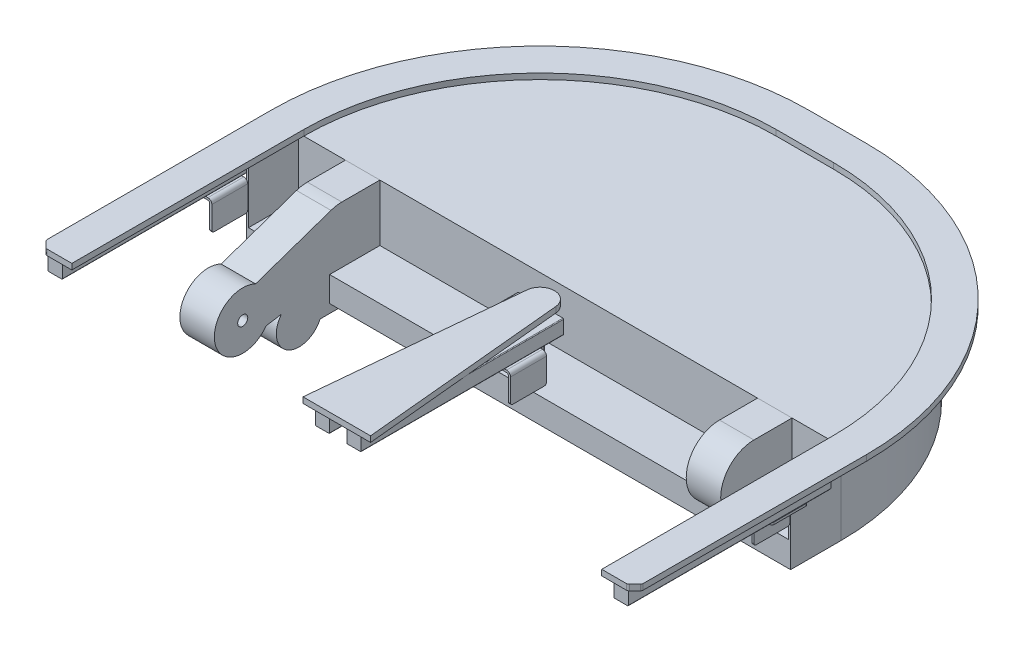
from build123d import *

# Parameters (mm, degrees)
BOSS_EXTRUDE1_DEPTH  = 114
BOSS_EXTRUDE2_DEPTH  = 35
SKETCH17_R           = 5.5
CUT_EXTRUDE3_DEPTH   = 30
BOSS_EXTRUDE7_START  = -65
SKETCH8_R            = 7
BOSS_EXTRUDE7_DEPTH  = 48
BOSS_EXTRUDE8_START  = -65
BOSS_EXTRUDE8_DEPTH  = 48
BOSS_EXTRUDE9_START  = -65
SKETCH11_R           = 7
BOSS_EXTRUDE9_DEPTH  = 48
BOSS_EXTRUDE3_DEPTH  = 122
BOSS_EXTRUDE4_DEPTH  = 8
SKETCH15_R           = 12.7
BOSS_EXTRUDE13_DEPTH = 79
SKETCH6_W            = 47
SKETCH6_H            = 330
BOSS_EXTRUDE6_DEPTH  = 8
CUT_EXTRUDE1_DEPTH   = 8
SKETCH12_W           = 46
SKETCH12_H           = 287
BOSS_EXTRUDE10_DEPTH = 8
CHAMFER2_SIZE        = 10
FILLET5_R            = 4
FILLET3_R            = 20
SKETCH13_W           = 20
SKETCH13_H           = 282
BOSS_EXTRUDE11_DEPTH = 20
BOSS_EXTRUDE12_START = -32
BOSS_EXTRUDE12_DEPTH = 50
FILLET6_R            = 3
FILLET7_R            = 1


with BuildPart() as part:
    # Sketch1 → Boss-Extrude1 (new body)
    with BuildSketch(Plane(origin=(0, 0, 0), x_dir=(1, 0, 0), z_dir=(0, 1, 0))):
        with BuildLine():
            Line((0, 0), (-336, 0))
            ThreePointArc((-336, 0), (-237.587878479, 237.587878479), (0, 336))
            Line((0, 336), (80, 336))
            ThreePointArc((80, 336), (317.587878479, 237.587878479), (416, 0))
            Line((416, 0), (80, 0))
            Line((80, 0), (0, 0))
        make_face()
    extrude(amount=BOSS_EXTRUDE1_DEPTH)

    # Sketch2 → Boss-Extrude2 (add)
    with BuildSketch(Plane.XZ):
        with BuildLine():
            Line((416, 70), (416, 0))
            ThreePointArc((416, 0), (317.587878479, -237.587878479), (80, -336))
            Line((80, -336), (0, -336))
            ThreePointArc((0, -336), (-237.587878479, -237.587878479), (-336, 0))
            Line((-336, 0), (-336, 70))
            Line((-336, 70), (416, 70))
        make_face()
    extrude(amount=-BOSS_EXTRUDE2_DEPTH)

    # Sketch17 → Cut-Extrude3 (cut)
    with BuildSketch(Plane.XZ):
        with Locations(Location((295.087878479, -215.087878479, 0), (0, 0, 270))):
            Circle(SKETCH17_R)
        with Locations(Location((-215.087878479, -215.087878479, 0), (0, 0, 270))):
            Circle(SKETCH17_R)
    extrude(amount=-CUT_EXTRUDE3_DEPTH, mode=Mode.SUBTRACT)

    # Sketch3 → Boss-Extrude3 (add)
    with BuildSketch(Plane.XZ):
        with BuildLine():
            Line((-336, 70), (-336, 0))
            ThreePointArc((-336, 0), (-237.587878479, -237.587878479), (0, -336))
            Line((0, -336), (80, -336))
            ThreePointArc((80, -336), (317.587878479, -237.587878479), (416, 0))
            Line((416, 0), (416, 70))
            Line((416, 70), (419, 70))
            Line((419, 70), (419, 0))
            ThreePointArc((419, 0), (319.709198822, -239.709198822), (80, -339))
            Line((80, -339), (0, -339))
            ThreePointArc((0, -339), (-239.709198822, -239.709198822), (-339, 0))
            Line((-339, 0), (-339, 70))
            Line((-339, 70), (-336, 70))
        make_face()
    extrude(amount=-BOSS_EXTRUDE3_DEPTH)

    # Sketch4 → Boss-Extrude4 (add)
    with BuildSketch(Plane(origin=(0, 122, 0), x_dir=(1, 0, 0), z_dir=(0, 1, 0))):
        with BuildLine():
            Line((0, 375), (80, 375))
            ThreePointArc((80, 375), (345.165042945, 265.165042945), (455, 0))
            Line((455, 0), (455, -36))
            Line((455, -36), (409, -36))
            Line((409, -36), (409, 0))
            ThreePointArc((409, 0), (312.63813101, 232.63813101), (80, 329))
            Line((80, 329), (0, 329))
            ThreePointArc((0, 329), (-232.63813101, 232.63813101), (-329, 0))
            Line((-329, 0), (-329, -36))
            Line((-329, -36), (-375, -36))
            Line((-375, -36), (-375, 0))
            ThreePointArc((-375, 0), (-265.165042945, 265.165042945), (0, 375))
        make_face()
    extrude(amount=-BOSS_EXTRUDE4_DEPTH)

    # Sketch15 → Boss-Extrude13 (add)
    with BuildSketch(Plane(origin=(0, 35, 0), x_dir=(1, 0, 0), z_dir=(0, 1, 0))):
        with Locations(Location((40, -52, 0), (0, 0, 90))):
            Circle(SKETCH15_R)
    extrude(amount=BOSS_EXTRUDE13_DEPTH)

    # Sketch6 → Boss-Extrude6 (add)
    with BuildSketch(Plane(origin=(0, 114, 0), x_dir=(1, 0, 0), z_dir=(0, 1, 0))):
        with Locations((16.5, -158)):
            Rectangle(SKETCH6_W, SKETCH6_H)
    boss_extrude6 = extrude(amount=BOSS_EXTRUDE6_DEPTH)

    # Mirror1: Boss-Extrude6 across plane
    add(boss_extrude6.mirror(Plane(origin=(40, 0, 0), x_dir=(0, 0, 1), z_dir=(1, 0, 0))))

    # Sketch7 → Cut-Extrude1 (cut)
    with BuildSketch(Plane(origin=(0, 122, 0), x_dir=(1, 0, 0), z_dir=(0, 1, 0))):
        Polygon((40, -19.806112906), (58.446601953, -21.553398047), (87, -323), (87, 7), (40, 47), (-7, 7), (-7, -323), (21.553398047, -21.553398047), align=None)
    extrude(amount=-CUT_EXTRUDE1_DEPTH, mode=Mode.SUBTRACT)

    # Sketch12 → Boss-Extrude10 (add)
    with BuildSketch(Plane(origin=(0, 122, 0), x_dir=(1, 0, 0), z_dir=(0, 1, 0))):
        with Locations((-352, -179.5)):
            Rectangle(SKETCH12_W, SKETCH12_H)
        with Locations((432, -179.5)):
            Rectangle(SKETCH12_W, SKETCH12_H)
    extrude(amount=-BOSS_EXTRUDE10_DEPTH)

    # Chamfer2
    chamfer2_edges = [part.edges().sort_by_distance(p)[0] for p in [
        (-375, 118, 323),
        (455, 118, 323),
    ]]
    chamfer(chamfer2_edges, length=CHAMFER2_SIZE)

    # Fillet5
    fillet5_edges = [part.edges().sort_by_distance(p)[0] for p in [
        (445, 118, 323),
        (455, 118, 313),
        (-375, 118, 313),
        (-365, 118, 323),
    ]]
    fillet(fillet5_edges, radius=FILLET5_R)

    # Fillet3
    fillet3_edges = [part.edges().sort_by_distance(p)[0] for p in [
        (58.446601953, 118, 21.553398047),
        (21.553398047, 118, 21.553398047),
        (40, 118, 19.806112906),
    ]]
    fillet(fillet3_edges, radius=FILLET3_R)


with BuildPart() as body_2:
    # Sketch8 → Boss-Extrude7 (new body)
    with BuildSketch(Plane.ZY.offset(336).offset(BOSS_EXTRUDE7_START)):
        with BuildLine():
            Line((0, 114), (0, 35))
            Line((0, 35), (70, 35))
            Line((70, 35), (70, 0))
            Line((70, 0), (3.5, 0))
            Line((3.5, 0), (3.5, -12))
            Line((3.5, -12), (83.365860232, -12))
            ThreePointArc((83.365860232, -12), (129.029933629, -26.487633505), (137.059598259, 20.741844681))
            Line((137.059598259, 20.741844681), (158.632713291, 17.289422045))
            ThreePointArc((158.632713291, 17.289422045), (229.356940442, 30.400170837), (173.14629846, 75.279695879))
            Line((173.14629846, 75.279695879), (68.09456753, 111.47266519))
            ThreePointArc((68.09456753, 111.47266519), (60.652342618, 113.363799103), (53, 114))
            Line((53, 114), (0, 114))
        make_face()
        with Locations((191, 40)):
            Circle(SKETCH8_R, mode=Mode.SUBTRACT)
    extrude(amount=-BOSS_EXTRUDE7_DEPTH)


with BuildPart() as body_3:
    # Sketch9 → Boss-Extrude8 (new body)
    with BuildSketch(Plane.ZY.offset(336).offset(BOSS_EXTRUDE8_START)):
        with BuildLine():
            Line((0, 114), (53, 114))
            ThreePointArc((53, 114), (98.52511331, 76.312147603), (70, 24.550887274))
            Line((70, 24.550887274), (70, 35))
            Line((70, 35), (0, 35))
            Line((0, 35), (0, 114))
        make_face()
    extrude(amount=-BOSS_EXTRUDE8_DEPTH)


with BuildPart() as body_4:
    # Sketch11 → Boss-Extrude9 (new body)
    with BuildSketch(Plane.ZY.offset(336).offset(BOSS_EXTRUDE9_START)):
        with BuildLine():
            Line((3.5, -12), (83.365860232, -12))
            ThreePointArc((83.365860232, -12), (129.029933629, -26.487633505), (137.059598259, 20.741844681))
            Line((137.059598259, 20.741844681), (158.632713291, 17.289422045))
            ThreePointArc((158.632713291, 17.289422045), (223.57663001, 17.590743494), (200.634662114, 78.348205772))
            Line((200.634662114, 78.348205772), (64.291609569, 112.60324369))
            ThreePointArc((64.291609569, 112.60324369), (58.688835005, 113.64948528), (53, 114))
            Line((53, 114), (0, 114))
            Line((0, 114), (0, 35))
            Line((0, 35), (70, 35))
            Line((70, 35), (70, 0))
            Line((70, 0), (3.5, 0))
            Line((3.5, 0), (3.5, -12))
        make_face()
        with Locations((191, 40)):
            Circle(SKETCH11_R, mode=Mode.SUBTRACT)
    extrude(amount=-BOSS_EXTRUDE9_DEPTH)


with BuildPart() as body_5:
    # Mirror3: mirrored copy
    add(body_2.part.mirror(Plane(origin=(40, 0, 0), x_dir=(0, 0, 1), z_dir=(1, 0, 0))))


with BuildPart() as body_6:
    # Mirror3 2: mirrored copy
    add(body_3.part.mirror(Plane(origin=(40, 0, 0), x_dir=(0, 0, 1), z_dir=(1, 0, 0))))


with BuildPart() as body_7:
    # Mirror3 3: mirrored copy
    add(body_4.part.mirror(Plane(origin=(40, 0, 0), x_dir=(0, 0, 1), z_dir=(1, 0, 0))))


with BuildPart() as body_4_2:
    # Sketch13 → Boss-Extrude11 (new body)
    with BuildSketch(Plane.XZ.offset(-114)):
        with Locations((-354, 180)):
            Rectangle(SKETCH13_W, SKETCH13_H)
    extrude(amount=BOSS_EXTRUDE11_DEPTH)

    # Fillet7
    fillet7_edges = [body_4_2.edges().sort_by_distance(p)[0] for p in [
        (-344, 94, 180),
        (-364, 94, 180),
        (-344, 114, 180),
        (-364, 114, 180),
    ]]
    fillet(fillet7_edges, radius=FILLET7_R)


with BuildPart() as body_5_2:
    # Sketch14 → Boss-Extrude12 (new body)
    with BuildSketch(Plane(origin=(0, 0, 39), x_dir=(-1, 0, 0), z_dir=(0, 0, -1)).offset(BOSS_EXTRUDE12_START)):
        with BuildLine():
            Line((364, 94), (341.54, 94))
            ThreePointArc((341.54, 94), (337.622628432, 92.377371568), (336, 88.46))
            Line((336, 88.46), (336, 54))
            Line((336, 54), (339, 54))
            Line((339, 54), (339, 88.46))
            ThreePointArc((339, 88.46), (339.743948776, 90.256051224), (341.54, 91))
            Line((341.54, 91), (364, 91))
            Line((364, 91), (364, 94))
        make_face()
    extrude(amount=-BOSS_EXTRUDE12_DEPTH)

    # Fillet6
    fillet6_edges = [body_5_2.edges().sort_by_distance(p)[0] for p in [
        (-364, 92.5, 71),
        (-337.5, 54, 121),
        (-364, 92.5, 121),
        (-337.5, 54, 71),
    ]]
    fillet(fillet6_edges, radius=FILLET6_R)


with BuildPart() as body_6_2:
    # Mirror4: mirrored copy
    add(body_4_2.part.mirror(Plane(origin=(40, 0, 0), x_dir=(0, 0, 1), z_dir=(1, 0, 0))))


with BuildPart() as body_7_2:
    # Mirror4 2: mirrored copy
    add(body_5_2.part.mirror(Plane(origin=(40, 0, 0), x_dir=(0, 0, 1), z_dir=(1, 0, 0))))


with BuildPart() as body_8:
    # Mirror5: mirrored copy
    add(body_4_2.part.mirror(Plane.ZY.offset(168)))


with BuildPart() as body_9:
    # Mirror5 2: mirrored copy
    add(body_5_2.part.mirror(Plane.ZY.offset(168)))


with BuildPart() as body_10:
    # Mirror6: mirrored copy
    add(body_7_2.part.mirror(Plane.ZY.offset(-248)))


with BuildPart() as body_11:
    # Mirror6 2: mirrored copy
    add(body_6_2.part.mirror(Plane.ZY.offset(-248)))


solid = Compound([part.part, body_2.part, body_6.part, body_4_2.part, body_5_2.part, body_6_2.part, body_7_2.part, body_8.part, body_9.part, body_10.part, body_11.part])
